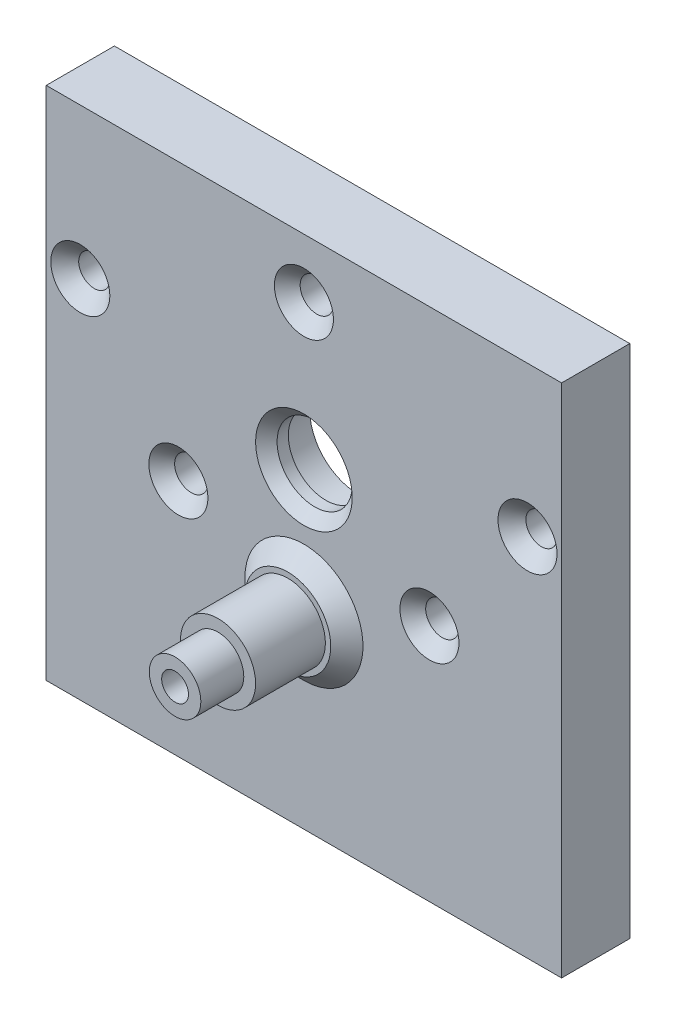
ISO-10303-21;
HEADER;
FILE_DESCRIPTION(('STEP AP214'),'2;1');
FILE_NAME('part.step','',(''),(''),'','','');
FILE_SCHEMA(('AUTOMOTIVE_DESIGN { 1 0 10303 214 1 1 1 1 }'));
ENDSEC;
DATA;
#1=APPLICATION_CONTEXT('core data for automotive mechanical design processes');
#2=APPLICATION_PROTOCOL_DEFINITION('international standard','automotive_design',2000,#1);
#3=PRODUCT_CONTEXT('',#1,'mechanical');
#4=PRODUCT('Part','Part','',(#3));
#5=PRODUCT_RELATED_PRODUCT_CATEGORY('part','',(#4));
#6=PRODUCT_DEFINITION_FORMATION('','',#4);
#7=PRODUCT_DEFINITION_CONTEXT('part definition',#1,'design');
#8=PRODUCT_DEFINITION('design','',#6,#7);
#9=PRODUCT_DEFINITION_SHAPE('','',#8);
#10=(LENGTH_UNIT() NAMED_UNIT(*) SI_UNIT(.MILLI.,.METRE.));
#11=(NAMED_UNIT(*) PLANE_ANGLE_UNIT() SI_UNIT($,.RADIAN.));
#12=(NAMED_UNIT(*) SI_UNIT($,.STERADIAN.) SOLID_ANGLE_UNIT());
#13=UNCERTAINTY_MEASURE_WITH_UNIT(LENGTH_MEASURE(1.E-05),#10,'distance_accuracy_value','');
#14=(GEOMETRIC_REPRESENTATION_CONTEXT(3) GLOBAL_UNCERTAINTY_ASSIGNED_CONTEXT((#13)) GLOBAL_UNIT_ASSIGNED_CONTEXT((#10,
#11,#12)) REPRESENTATION_CONTEXT('',''));
#15=CARTESIAN_POINT('',(0.,0.,0.));
#16=DIRECTION('',(0.,0.,1.));
#17=DIRECTION('',(1.,0.,0.));
#18=AXIS2_PLACEMENT_3D('',#15,#16,#17);
#19=CARTESIAN_POINT('',(0.,0.,6.35));
#20=DIRECTION('',(0.,0.,-1.));
#21=DIRECTION('',(-1.,0.,0.));
#22=AXIS2_PLACEMENT_3D('',#19,#20,#21);
#23=PLANE('',#22);
#24=CARTESIAN_POINT('',(35.6913429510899,22.2499999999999,6.35));
#25=DIRECTION('',(0.,0.,1.));
#26=DIRECTION('',(1.,0.,0.));
#27=AXIS2_PLACEMENT_3D('',#24,#25,#26);
#28=CIRCLE('',#27,2.75);
#29=CARTESIAN_POINT('',(38.4413429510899,22.2499999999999,6.35));
#30=VERTEX_POINT('',#29);
#31=EDGE_CURVE('E221',#30,#30,#28,.T.);
#32=ORIENTED_EDGE('',*,*,#31,.F.);
#33=EDGE_LOOP('',(#32));
#34=FACE_BOUND('',#33,.T.);
#35=CARTESIAN_POINT('',(24.,42.5,6.35));
#36=DIRECTION('',(0.,0.,1.));
#37=DIRECTION('',(1.,0.,0.));
#38=AXIS2_PLACEMENT_3D('',#35,#36,#37);
#39=CIRCLE('',#38,2.75);
#40=CARTESIAN_POINT('',(26.75,42.5,6.35));
#41=VERTEX_POINT('',#40);
#42=EDGE_CURVE('E214',#41,#41,#39,.T.);
#43=ORIENTED_EDGE('',*,*,#42,.F.);
#44=EDGE_LOOP('',(#43));
#45=FACE_BOUND('',#44,.T.);
#46=CARTESIAN_POINT('',(24.,17.5,6.35));
#47=DIRECTION('',(0.,0.,-1.));
#48=DIRECTION('',(-1.,0.,0.));
#49=AXIS2_PLACEMENT_3D('',#46,#47,#48);
#50=CIRCLE('',#49,5.49999999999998);
#51=CARTESIAN_POINT('',(18.5,17.5,6.35));
#52=VERTEX_POINT('',#51);
#53=EDGE_CURVE('E11',#52,#52,#50,.T.);
#54=ORIENTED_EDGE('',*,*,#53,.T.);
#55=EDGE_LOOP('',(#54));
#56=FACE_BOUND('',#55,.T.);
#57=CARTESIAN_POINT('',(24.,29.,6.35));
#58=DIRECTION('',(0.,0.,-1.));
#59=DIRECTION('',(-1.,0.,0.));
#60=AXIS2_PLACEMENT_3D('',#57,#58,#59);
#61=CIRCLE('',#60,4.50000000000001);
#62=CARTESIAN_POINT('',(19.5,29.,6.35));
#63=VERTEX_POINT('',#62);
#64=EDGE_CURVE('E198',#63,#63,#61,.T.);
#65=ORIENTED_EDGE('',*,*,#64,.T.);
#66=EDGE_LOOP('',(#65));
#67=FACE_BOUND('',#66,.T.);
#68=CARTESIAN_POINT('',(44.825,34.,6.35));
#69=DIRECTION('',(0.,0.,1.));
#70=DIRECTION('',(1.,0.,0.));
#71=AXIS2_PLACEMENT_3D('',#68,#69,#70);
#72=CIRCLE('',#71,2.75);
#73=CARTESIAN_POINT('',(47.575,34.,6.35));
#74=VERTEX_POINT('',#73);
#75=EDGE_CURVE('E130',#74,#74,#72,.T.);
#76=ORIENTED_EDGE('',*,*,#75,.F.);
#77=EDGE_LOOP('',(#76));
#78=FACE_BOUND('',#77,.T.);
#79=CARTESIAN_POINT('',(3.175,34.,6.35));
#80=DIRECTION('',(0.,0.,1.));
#81=DIRECTION('',(1.,0.,0.));
#82=AXIS2_PLACEMENT_3D('',#79,#80,#81);
#83=CIRCLE('',#82,2.75);
#84=CARTESIAN_POINT('',(5.925,34.,6.35));
#85=VERTEX_POINT('',#84);
#86=EDGE_CURVE('E137',#85,#85,#83,.T.);
#87=ORIENTED_EDGE('',*,*,#86,.F.);
#88=EDGE_LOOP('',(#87));
#89=FACE_BOUND('',#88,.T.);
#90=DIRECTION('',(0.,-1.,0.));
#91=VECTOR('',#90,1.);
#92=CARTESIAN_POINT('',(0.,0.,6.35));
#93=LINE('',#92,#91);
#94=CARTESIAN_POINT('',(0.,48.,6.35));
#95=VERTEX_POINT('',#94);
#96=CARTESIAN_POINT('',(0.,0.,6.35));
#97=VERTEX_POINT('',#96);
#98=EDGE_CURVE('E178',#95,#97,#93,.T.);
#99=ORIENTED_EDGE('',*,*,#98,.T.);
#100=DIRECTION('',(1.,0.,0.));
#101=VECTOR('',#100,1.);
#102=CARTESIAN_POINT('',(0.,0.,6.35));
#103=LINE('',#102,#101);
#104=CARTESIAN_POINT('',(48.,0.,6.35));
#105=VERTEX_POINT('',#104);
#106=EDGE_CURVE('E97',#97,#105,#103,.T.);
#107=ORIENTED_EDGE('',*,*,#106,.T.);
#108=DIRECTION('',(0.,1.,0.));
#109=VECTOR('',#108,1.);
#110=CARTESIAN_POINT('',(48.,0.,6.35));
#111=LINE('',#110,#109);
#112=CARTESIAN_POINT('',(48.,48.,6.35));
#113=VERTEX_POINT('',#112);
#114=EDGE_CURVE('E181',#105,#113,#111,.T.);
#115=ORIENTED_EDGE('',*,*,#114,.T.);
#116=DIRECTION('',(-1.,0.,0.));
#117=VECTOR('',#116,1.);
#118=CARTESIAN_POINT('',(0.,48.,6.35));
#119=LINE('',#118,#117);
#120=EDGE_CURVE('E65',#113,#95,#119,.T.);
#121=ORIENTED_EDGE('',*,*,#120,.T.);
#122=EDGE_LOOP('',(#99,#107,#115,#121));
#123=FACE_BOUND('',#122,.T.);
#124=CARTESIAN_POINT('',(12.30865704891,22.2500000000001,6.35));
#125=DIRECTION('',(0.,0.,1.));
#126=DIRECTION('',(1.,0.,0.));
#127=AXIS2_PLACEMENT_3D('',#124,#125,#126);
#128=CIRCLE('',#127,2.75);
#129=CARTESIAN_POINT('',(15.05865704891,22.2500000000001,6.35));
#130=VERTEX_POINT('',#129);
#131=EDGE_CURVE('E257',#130,#130,#128,.T.);
#132=ORIENTED_EDGE('',*,*,#131,.F.);
#133=EDGE_LOOP('',(#132));
#134=FACE_BOUND('',#133,.T.);
#135=ADVANCED_FACE('F45',(#34,#45,#56,#67,#78,#89,#123,#134),#23,.F.);
#136=CARTESIAN_POINT('',(0.,0.,6.35));
#137=DIRECTION('',(1.,0.,0.));
#138=DIRECTION('',(0.,0.,-1.));
#139=AXIS2_PLACEMENT_3D('',#136,#137,#138);
#140=PLANE('',#139);
#141=DIRECTION('',(0.,-1.,0.));
#142=VECTOR('',#141,1.);
#143=CARTESIAN_POINT('',(0.,0.,0.));
#144=LINE('',#143,#142);
#145=CARTESIAN_POINT('',(0.,48.,0.));
#146=VERTEX_POINT('',#145);
#147=CARTESIAN_POINT('',(0.,0.,0.));
#148=VERTEX_POINT('',#147);
#149=EDGE_CURVE('E175',#146,#148,#144,.T.);
#150=ORIENTED_EDGE('',*,*,#149,.T.);
#151=DIRECTION('',(0.,0.,-1.));
#152=VECTOR('',#151,1.);
#153=CARTESIAN_POINT('',(0.,0.,6.35));
#154=LINE('',#153,#152);
#155=EDGE_CURVE('E196',#97,#148,#154,.T.);
#156=ORIENTED_EDGE('',*,*,#155,.F.);
#157=ORIENTED_EDGE('',*,*,#98,.F.);
#158=DIRECTION('',(0.,0.,-1.));
#159=VECTOR('',#158,1.);
#160=CARTESIAN_POINT('',(0.,48.,6.35));
#161=LINE('',#160,#159);
#162=EDGE_CURVE('E184',#95,#146,#161,.T.);
#163=ORIENTED_EDGE('',*,*,#162,.T.);
#164=EDGE_LOOP('',(#150,#156,#157,#163));
#165=FACE_BOUND('',#164,.T.);
#166=ADVANCED_FACE('F242',(#165),#140,.F.);
#167=CARTESIAN_POINT('',(0.,0.,6.35));
#168=DIRECTION('',(0.,1.,0.));
#169=DIRECTION('',(0.,0.,1.));
#170=AXIS2_PLACEMENT_3D('',#167,#168,#169);
#171=PLANE('',#170);
#172=CARTESIAN_POINT('',(3.175,0.,3.175));
#173=DIRECTION('',(0.,-1.,0.));
#174=DIRECTION('',(0.,0.,-1.));
#175=AXIS2_PLACEMENT_3D('',#172,#173,#174);
#176=CIRCLE('',#175,1.02499999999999);
#177=CARTESIAN_POINT('',(3.175,0.,2.15000000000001));
#178=VERTEX_POINT('',#177);
#179=EDGE_CURVE('E118',#178,#178,#176,.T.);
#180=ORIENTED_EDGE('',*,*,#179,.F.);
#181=EDGE_LOOP('',(#180));
#182=FACE_BOUND('',#181,.T.);
#183=CARTESIAN_POINT('',(44.825,0.,3.175));
#184=DIRECTION('',(0.,-1.,0.));
#185=DIRECTION('',(0.,0.,-1.));
#186=AXIS2_PLACEMENT_3D('',#183,#184,#185);
#187=CIRCLE('',#186,1.02499999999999);
#188=CARTESIAN_POINT('',(44.825,0.,2.15000000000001));
#189=VERTEX_POINT('',#188);
#190=EDGE_CURVE('E117',#189,#189,#187,.T.);
#191=ORIENTED_EDGE('',*,*,#190,.F.);
#192=EDGE_LOOP('',(#191));
#193=FACE_BOUND('',#192,.T.);
#194=DIRECTION('',(1.,0.,0.));
#195=VECTOR('',#194,1.);
#196=CARTESIAN_POINT('',(0.,0.,0.));
#197=LINE('',#196,#195);
#198=CARTESIAN_POINT('',(48.,0.,0.));
#199=VERTEX_POINT('',#198);
#200=EDGE_CURVE('E187',#148,#199,#197,.T.);
#201=ORIENTED_EDGE('',*,*,#200,.T.);
#202=DIRECTION('',(0.,0.,-1.));
#203=VECTOR('',#202,1.);
#204=CARTESIAN_POINT('',(48.,0.,6.35));
#205=LINE('',#204,#203);
#206=EDGE_CURVE('E194',#105,#199,#205,.T.);
#207=ORIENTED_EDGE('',*,*,#206,.F.);
#208=ORIENTED_EDGE('',*,*,#106,.F.);
#209=ORIENTED_EDGE('',*,*,#155,.T.);
#210=EDGE_LOOP('',(#201,#207,#208,#209));
#211=FACE_BOUND('',#210,.T.);
#212=ADVANCED_FACE('F299',(#182,#193,#211),#171,.F.);
#213=CARTESIAN_POINT('',(48.,0.,6.35));
#214=DIRECTION('',(-1.,0.,0.));
#215=DIRECTION('',(0.,0.,1.));
#216=AXIS2_PLACEMENT_3D('',#213,#214,#215);
#217=PLANE('',#216);
#218=DIRECTION('',(0.,1.,0.));
#219=VECTOR('',#218,1.);
#220=CARTESIAN_POINT('',(48.,0.,0.));
#221=LINE('',#220,#219);
#222=CARTESIAN_POINT('',(48.,48.,0.));
#223=VERTEX_POINT('',#222);
#224=EDGE_CURVE('E83',#199,#223,#221,.T.);
#225=ORIENTED_EDGE('',*,*,#224,.T.);
#226=DIRECTION('',(0.,0.,-1.));
#227=VECTOR('',#226,1.);
#228=CARTESIAN_POINT('',(48.,48.,6.35));
#229=LINE('',#228,#227);
#230=EDGE_CURVE('E192',#113,#223,#229,.T.);
#231=ORIENTED_EDGE('',*,*,#230,.F.);
#232=ORIENTED_EDGE('',*,*,#114,.F.);
#233=ORIENTED_EDGE('',*,*,#206,.T.);
#234=EDGE_LOOP('',(#225,#231,#232,#233));
#235=FACE_BOUND('',#234,.T.);
#236=ADVANCED_FACE('F298',(#235),#217,.F.);
#237=CARTESIAN_POINT('',(0.,48.,6.35));
#238=DIRECTION('',(0.,-1.,0.));
#239=DIRECTION('',(0.,0.,-1.));
#240=AXIS2_PLACEMENT_3D('',#237,#238,#239);
#241=PLANE('',#240);
#242=DIRECTION('',(-1.,0.,0.));
#243=VECTOR('',#242,1.);
#244=CARTESIAN_POINT('',(0.,48.,0.));
#245=LINE('',#244,#243);
#246=EDGE_CURVE('E89',#223,#146,#245,.T.);
#247=ORIENTED_EDGE('',*,*,#246,.T.);
#248=ORIENTED_EDGE('',*,*,#162,.F.);
#249=ORIENTED_EDGE('',*,*,#120,.F.);
#250=ORIENTED_EDGE('',*,*,#230,.T.);
#251=EDGE_LOOP('',(#247,#248,#249,#250));
#252=FACE_BOUND('',#251,.T.);
#253=ADVANCED_FACE('F292',(#252),#241,.F.);
#254=CARTESIAN_POINT('',(0.,0.,0.));
#255=DIRECTION('',(0.,0.,-1.));
#256=DIRECTION('',(-1.,0.,0.));
#257=AXIS2_PLACEMENT_3D('',#254,#255,#256);
#258=PLANE('',#257);
#259=CARTESIAN_POINT('',(44.825,34.,0.));
#260=DIRECTION('',(0.,0.,-1.));
#261=DIRECTION('',(-1.,0.,0.));
#262=AXIS2_PLACEMENT_3D('',#259,#260,#261);
#263=CIRCLE('',#262,1.44999999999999);
#264=CARTESIAN_POINT('',(43.375,34.,0.));
#265=VERTEX_POINT('',#264);
#266=EDGE_CURVE('E136',#265,#265,#263,.T.);
#267=ORIENTED_EDGE('',*,*,#266,.F.);
#268=EDGE_LOOP('',(#267));
#269=FACE_BOUND('',#268,.T.);
#270=CARTESIAN_POINT('',(3.175,34.,0.));
#271=DIRECTION('',(0.,0.,-1.));
#272=DIRECTION('',(-1.,0.,0.));
#273=AXIS2_PLACEMENT_3D('',#270,#271,#272);
#274=CIRCLE('',#273,1.44999999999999);
#275=CARTESIAN_POINT('',(1.72500000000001,34.,0.));
#276=VERTEX_POINT('',#275);
#277=EDGE_CURVE('E143',#276,#276,#274,.T.);
#278=ORIENTED_EDGE('',*,*,#277,.F.);
#279=EDGE_LOOP('',(#278));
#280=FACE_BOUND('',#279,.T.);
#281=CARTESIAN_POINT('',(24.,29.,0.));
#282=DIRECTION('',(0.,0.,-1.));
#283=DIRECTION('',(-1.,0.,0.));
#284=AXIS2_PLACEMENT_3D('',#281,#282,#283);
#285=CIRCLE('',#284,17.5);
#286=CARTESIAN_POINT('',(6.5,29.,0.));
#287=VERTEX_POINT('',#286);
#288=EDGE_CURVE('E151',#287,#287,#285,.T.);
#289=ORIENTED_EDGE('',*,*,#288,.F.);
#290=EDGE_LOOP('',(#289));
#291=FACE_BOUND('',#290,.T.);
#292=ORIENTED_EDGE('',*,*,#149,.F.);
#293=ORIENTED_EDGE('',*,*,#246,.F.);
#294=ORIENTED_EDGE('',*,*,#224,.F.);
#295=ORIENTED_EDGE('',*,*,#200,.F.);
#296=EDGE_LOOP('',(#292,#293,#294,#295));
#297=FACE_BOUND('',#296,.T.);
#298=ADVANCED_FACE('F288',(#269,#280,#291,#297),#258,.T.);
#299=CARTESIAN_POINT('',(24.,17.5,7.85));
#300=DIRECTION('',(0.,0.,1.));
#301=DIRECTION('',(1.,0.,0.));
#302=AXIS2_PLACEMENT_3D('',#299,#300,#301);
#303=PLANE('',#302);
#304=CARTESIAN_POINT('',(24.,17.5,7.85));
#305=DIRECTION('',(0.,0.,1.));
#306=DIRECTION('',(1.,0.,0.));
#307=AXIS2_PLACEMENT_3D('',#304,#305,#306);
#308=CIRCLE('',#307,3.99999999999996);
#309=CARTESIAN_POINT('',(28.,17.5,7.85));
#310=VERTEX_POINT('',#309);
#311=EDGE_CURVE('E56',#310,#310,#308,.T.);
#312=ORIENTED_EDGE('',*,*,#311,.T.);
#313=EDGE_LOOP('',(#312));
#314=FACE_BOUND('',#313,.T.);
#315=CARTESIAN_POINT('',(24.,17.5,7.85));
#316=DIRECTION('',(0.,0.,1.));
#317=DIRECTION('',(1.,0.,0.));
#318=AXIS2_PLACEMENT_3D('',#315,#316,#317);
#319=CIRCLE('',#318,3.5);
#320=CARTESIAN_POINT('',(27.5,17.5,7.85));
#321=VERTEX_POINT('',#320);
#322=EDGE_CURVE('E166',#321,#321,#319,.T.);
#323=ORIENTED_EDGE('',*,*,#322,.F.);
#324=EDGE_LOOP('',(#323));
#325=FACE_BOUND('',#324,.T.);
#326=ADVANCED_FACE('F291',(#314,#325),#303,.T.);
#327=CARTESIAN_POINT('',(24.,17.5,7.85));
#328=DIRECTION('',(0.,0.,1.));
#329=DIRECTION('',(1.,0.,0.));
#330=AXIS2_PLACEMENT_3D('',#327,#328,#329);
#331=CYLINDRICAL_SURFACE('',#330,3.5);
#332=CARTESIAN_POINT('',(24.,17.5,14.35));
#333=DIRECTION('',(0.,0.,1.));
#334=DIRECTION('',(1.,0.,0.));
#335=AXIS2_PLACEMENT_3D('',#332,#333,#334);
#336=CIRCLE('',#335,3.5);
#337=CARTESIAN_POINT('',(27.5,17.5,14.35));
#338=VERTEX_POINT('',#337);
#339=EDGE_CURVE('E165',#338,#338,#336,.T.);
#340=CARTESIAN_POINT('',(27.5,17.5,7.85));
#341=CARTESIAN_POINT('',(27.5,17.5,7.91770833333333));
#342=CARTESIAN_POINT('',(27.5,17.5,7.98541666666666));
#343=CARTESIAN_POINT('',(27.5,17.5,8.12083333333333));
#344=CARTESIAN_POINT('',(27.5,17.5,8.18854166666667));
#345=CARTESIAN_POINT('',(27.5,17.5,8.32395833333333));
#346=CARTESIAN_POINT('',(27.5,17.5,8.39166666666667));
#347=CARTESIAN_POINT('',(27.5,17.5,8.52708333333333));
#348=CARTESIAN_POINT('',(27.5,17.5,8.59479166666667));
#349=CARTESIAN_POINT('',(27.5,17.5,8.73020833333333));
#350=CARTESIAN_POINT('',(27.5,17.5,8.79791666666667));
#351=CARTESIAN_POINT('',(27.5,17.5,8.93333333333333));
#352=CARTESIAN_POINT('',(27.5,17.5,9.00104166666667));
#353=CARTESIAN_POINT('',(27.5,17.5,9.13645833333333));
#354=CARTESIAN_POINT('',(27.5,17.5,9.20416666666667));
#355=CARTESIAN_POINT('',(27.5,17.5,9.33958333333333));
#356=CARTESIAN_POINT('',(27.5,17.5,9.40729166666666));
#357=CARTESIAN_POINT('',(27.5,17.5,9.54270833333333));
#358=CARTESIAN_POINT('',(27.5,17.5,9.61041666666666));
#359=CARTESIAN_POINT('',(27.5,17.5,9.74583333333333));
#360=CARTESIAN_POINT('',(27.5,17.5,9.81354166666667));
#361=CARTESIAN_POINT('',(27.5,17.5,9.94895833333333));
#362=CARTESIAN_POINT('',(27.5,17.5,10.0166666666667));
#363=CARTESIAN_POINT('',(27.5,17.5,10.1520833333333));
#364=CARTESIAN_POINT('',(27.5,17.5,10.2197916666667));
#365=CARTESIAN_POINT('',(27.5,17.5,10.3552083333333));
#366=CARTESIAN_POINT('',(27.5,17.5,10.4229166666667));
#367=CARTESIAN_POINT('',(27.5,17.5,10.5583333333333));
#368=CARTESIAN_POINT('',(27.5,17.5,10.6260416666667));
#369=CARTESIAN_POINT('',(27.5,17.5,10.7614583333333));
#370=CARTESIAN_POINT('',(27.5,17.5,10.8291666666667));
#371=CARTESIAN_POINT('',(27.5,17.5,10.9645833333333));
#372=CARTESIAN_POINT('',(27.5,17.5,11.0322916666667));
#373=CARTESIAN_POINT('',(27.5,17.5,11.1677083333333));
#374=CARTESIAN_POINT('',(27.5,17.5,11.2354166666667));
#375=CARTESIAN_POINT('',(27.5,17.5,11.3708333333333));
#376=CARTESIAN_POINT('',(27.5,17.5,11.4385416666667));
#377=CARTESIAN_POINT('',(27.5,17.5,11.5739583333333));
#378=CARTESIAN_POINT('',(27.5,17.5,11.6416666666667));
#379=CARTESIAN_POINT('',(27.5,17.5,11.7770833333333));
#380=CARTESIAN_POINT('',(27.5,17.5,11.8447916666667));
#381=CARTESIAN_POINT('',(27.5,17.5,11.9802083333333));
#382=CARTESIAN_POINT('',(27.5,17.5,12.0479166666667));
#383=CARTESIAN_POINT('',(27.5,17.5,12.1833333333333));
#384=CARTESIAN_POINT('',(27.5,17.5,12.2510416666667));
#385=CARTESIAN_POINT('',(27.5,17.5,12.3864583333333));
#386=CARTESIAN_POINT('',(27.5,17.5,12.4541666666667));
#387=CARTESIAN_POINT('',(27.5,17.5,12.5895833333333));
#388=CARTESIAN_POINT('',(27.5,17.5,12.6572916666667));
#389=CARTESIAN_POINT('',(27.5,17.5,12.7927083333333));
#390=CARTESIAN_POINT('',(27.5,17.5,12.8604166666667));
#391=CARTESIAN_POINT('',(27.5,17.5,12.9958333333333));
#392=CARTESIAN_POINT('',(27.5,17.5,13.0635416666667));
#393=CARTESIAN_POINT('',(27.5,17.5,13.1989583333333));
#394=CARTESIAN_POINT('',(27.5,17.5,13.2666666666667));
#395=CARTESIAN_POINT('',(27.5,17.5,13.4020833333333));
#396=CARTESIAN_POINT('',(27.5,17.5,13.4697916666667));
#397=CARTESIAN_POINT('',(27.5,17.5,13.6052083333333));
#398=CARTESIAN_POINT('',(27.5,17.5,13.6729166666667));
#399=CARTESIAN_POINT('',(27.5,17.5,13.8083333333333));
#400=CARTESIAN_POINT('',(27.5,17.5,13.8760416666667));
#401=CARTESIAN_POINT('',(27.5,17.5,14.0114583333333));
#402=CARTESIAN_POINT('',(27.5,17.5,14.0791666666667));
#403=CARTESIAN_POINT('',(27.5,17.5,14.2145833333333));
#404=CARTESIAN_POINT('',(27.5,17.5,14.2822916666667));
#405=CARTESIAN_POINT('',(27.5,17.5,14.35));
#406=B_SPLINE_CURVE_WITH_KNOTS('',3,(#340,#341,#342,#343,#344,#345,#346,#347,#348,#349,#350,
#351,#352,#353,#354,#355,#356,#357,#358,#359,#360,#361,#362,#363,#364,#365,#366,#367,#368,#369,
#370,#371,#372,#373,#374,#375,#376,#377,#378,#379,#380,#381,#382,#383,#384,#385,#386,#387,#388,
#389,#390,#391,#392,#393,#394,#395,#396,#397,#398,#399,#400,#401,#402,#403,#404,#405),
.UNSPECIFIED.,.F.,.F.,(4,2,2,2,2,2,2,2,2,2,2,2,2,2,2,2,2,2,2,2,2,2,2,2,2,2,2,2,2,2,2,2,4),(0.,
0.203124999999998,0.406249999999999,0.609374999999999,0.812499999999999,1.015625,1.21875,
1.421875,1.625,1.828125,2.03125,2.234375,2.4375,2.640625,2.84375,3.046875,3.25,3.453125,3.65625,
3.859375,4.0625,4.265625,4.46875,4.671875,4.875,5.078125,5.28125,5.484375,5.6875,5.890625,
6.09375,6.296875,6.5),.UNSPECIFIED.);
#407=EDGE_CURVE('BSEAM354',#321,#338,#406,.T.);
#408=ORIENTED_EDGE('',*,*,#322,.T.);
#409=ORIENTED_EDGE('',*,*,#339,.F.);
#410=ORIENTED_EDGE('',*,*,#407,.T.);
#411=ORIENTED_EDGE('',*,*,#407,.F.);
#412=EDGE_LOOP('',(#408,#410,#409,#411));
#413=FACE_BOUND('',#412,.T.);
#414=ADVANCED_FACE('F354',(#413),#331,.T.);
#415=CARTESIAN_POINT('',(24.,17.5,18.35));
#416=DIRECTION('',(0.,0.,1.));
#417=DIRECTION('',(1.,0.,0.));
#418=AXIS2_PLACEMENT_3D('',#415,#416,#417);
#419=PLANE('',#418);
#420=CARTESIAN_POINT('',(24.,17.5,18.35));
#421=DIRECTION('',(0.,0.,1.));
#422=DIRECTION('',(1.,0.,0.));
#423=AXIS2_PLACEMENT_3D('',#420,#421,#422);
#424=CIRCLE('',#423,1.25);
#425=CARTESIAN_POINT('',(25.25,17.5,18.35));
#426=VERTEX_POINT('',#425);
#427=EDGE_CURVE('E157',#426,#426,#424,.T.);
#428=ORIENTED_EDGE('',*,*,#427,.F.);
#429=EDGE_LOOP('',(#428));
#430=FACE_BOUND('',#429,.T.);
#431=CARTESIAN_POINT('',(24.,17.5,18.35));
#432=DIRECTION('',(0.,0.,1.));
#433=DIRECTION('',(1.,0.,0.));
#434=AXIS2_PLACEMENT_3D('',#431,#432,#433);
#435=CIRCLE('',#434,2.4);
#436=CARTESIAN_POINT('',(26.4,17.5,18.35));
#437=VERTEX_POINT('',#436);
#438=EDGE_CURVE('E169',#437,#437,#435,.T.);
#439=ORIENTED_EDGE('',*,*,#438,.T.);
#440=EDGE_LOOP('',(#439));
#441=FACE_BOUND('',#440,.T.);
#442=ADVANCED_FACE('F357',(#430,#441),#419,.T.);
#443=CARTESIAN_POINT('',(24.,17.5,14.35));
#444=DIRECTION('',(0.,0.,1.));
#445=DIRECTION('',(1.,0.,0.));
#446=AXIS2_PLACEMENT_3D('',#443,#444,#445);
#447=CYLINDRICAL_SURFACE('',#446,2.4);
#448=CARTESIAN_POINT('',(24.,17.5,14.35));
#449=DIRECTION('',(0.,0.,1.));
#450=DIRECTION('',(1.,0.,0.));
#451=AXIS2_PLACEMENT_3D('',#448,#449,#450);
#452=CIRCLE('',#451,2.4);
#453=CARTESIAN_POINT('',(26.4,17.5,14.35));
#454=VERTEX_POINT('',#453);
#455=EDGE_CURVE('E172',#454,#454,#452,.T.);
#456=ORIENTED_EDGE('',*,*,#455,.T.);
#457=EDGE_LOOP('',(#456));
#458=FACE_BOUND('',#457,.T.);
#459=ORIENTED_EDGE('',*,*,#438,.F.);
#460=EDGE_LOOP('',(#459));
#461=FACE_BOUND('',#460,.T.);
#462=ADVANCED_FACE('F362',(#458,#461),#447,.T.);
#463=CARTESIAN_POINT('',(24.,17.5,14.35));
#464=DIRECTION('',(0.,0.,1.));
#465=DIRECTION('',(1.,0.,0.));
#466=AXIS2_PLACEMENT_3D('',#463,#464,#465);
#467=PLANE('',#466);
#468=ORIENTED_EDGE('',*,*,#455,.F.);
#469=EDGE_LOOP('',(#468));
#470=FACE_BOUND('',#469,.T.);
#471=ORIENTED_EDGE('',*,*,#339,.T.);
#472=EDGE_LOOP('',(#471));
#473=FACE_BOUND('',#472,.T.);
#474=ADVANCED_FACE('F352',(#470,#473),#467,.T.);
#475=CARTESIAN_POINT('',(24.,17.5,9.85));
#476=DIRECTION('',(0.,0.,1.));
#477=DIRECTION('',(1.,0.,0.));
#478=AXIS2_PLACEMENT_3D('',#475,#476,#477);
#479=CONICAL_SURFACE('',#478,1.25,1.02974425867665);
#480=CARTESIAN_POINT('',(24.,17.5,9.09892422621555));
#481=VERTEX_POINT('',#480);
#482=VERTEX_LOOP('',#481);
#483=FACE_BOUND('',#482,.T.);
#484=CARTESIAN_POINT('',(24.,17.5,9.85));
#485=DIRECTION('',(0.,0.,1.));
#486=DIRECTION('',(1.,0.,0.));
#487=AXIS2_PLACEMENT_3D('',#484,#485,#486);
#488=CIRCLE('',#487,1.25);
#489=CARTESIAN_POINT('',(25.25,17.5,9.85));
#490=VERTEX_POINT('',#489);
#491=EDGE_CURVE('E162',#490,#490,#488,.T.);
#492=ORIENTED_EDGE('',*,*,#491,.T.);
#493=EDGE_LOOP('',(#492));
#494=FACE_BOUND('',#493,.T.);
#495=ADVANCED_FACE('F348',(#483,#494),#479,.F.);
#496=CARTESIAN_POINT('',(24.,17.5,18.35));
#497=DIRECTION('',(0.,0.,1.));
#498=DIRECTION('',(1.,0.,0.));
#499=AXIS2_PLACEMENT_3D('',#496,#497,#498);
#500=CYLINDRICAL_SURFACE('',#499,1.25);
#501=ORIENTED_EDGE('',*,*,#491,.F.);
#502=EDGE_LOOP('',(#501));
#503=FACE_BOUND('',#502,.T.);
#504=ORIENTED_EDGE('',*,*,#427,.T.);
#505=EDGE_LOOP('',(#504));
#506=FACE_BOUND('',#505,.T.);
#507=ADVANCED_FACE('F284',(#503,#506),#500,.F.);
#508=CARTESIAN_POINT('',(24.,29.,1.3));
#509=DIRECTION('',(0.,0.,-1.));
#510=DIRECTION('',(-1.,0.,0.));
#511=AXIS2_PLACEMENT_3D('',#508,#509,#510);
#512=CYLINDRICAL_SURFACE('',#511,17.5);
#513=CARTESIAN_POINT('',(24.,29.,1.3));
#514=DIRECTION('',(0.,0.,-1.));
#515=DIRECTION('',(-1.,0.,0.));
#516=AXIS2_PLACEMENT_3D('',#513,#514,#515);
#517=CIRCLE('',#516,17.5);
#518=CARTESIAN_POINT('',(6.5,29.,1.3));
#519=VERTEX_POINT('',#518);
#520=EDGE_CURVE('E154',#519,#519,#517,.T.);
#521=ORIENTED_EDGE('',*,*,#520,.F.);
#522=EDGE_LOOP('',(#521));
#523=FACE_BOUND('',#522,.T.);
#524=ORIENTED_EDGE('',*,*,#288,.T.);
#525=EDGE_LOOP('',(#524));
#526=FACE_BOUND('',#525,.T.);
#527=ADVANCED_FACE('F273',(#523,#526),#512,.F.);
#528=CARTESIAN_POINT('',(24.,29.,1.3));
#529=DIRECTION('',(0.,0.,-1.));
#530=DIRECTION('',(-1.,0.,0.));
#531=AXIS2_PLACEMENT_3D('',#528,#529,#530);
#532=PLANE('',#531);
#533=CARTESIAN_POINT('',(12.30865704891,22.2500000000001,1.3));
#534=DIRECTION('',(0.,0.,-1.));
#535=DIRECTION('',(-1.,0.,0.));
#536=AXIS2_PLACEMENT_3D('',#533,#534,#535);
#537=CIRCLE('',#536,1.54999999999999);
#538=CARTESIAN_POINT('',(10.75865704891,22.2500000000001,1.3));
#539=VERTEX_POINT('',#538);
#540=EDGE_CURVE('E50',#539,#539,#537,.T.);
#541=ORIENTED_EDGE('',*,*,#540,.F.);
#542=EDGE_LOOP('',(#541));
#543=FACE_BOUND('',#542,.T.);
#544=CARTESIAN_POINT('',(35.6913429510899,22.2499999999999,1.3));
#545=DIRECTION('',(0.,0.,-1.));
#546=DIRECTION('',(-1.,0.,0.));
#547=AXIS2_PLACEMENT_3D('',#544,#545,#546);
#548=CIRCLE('',#547,1.54999999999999);
#549=CARTESIAN_POINT('',(34.1413429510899,22.2499999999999,1.3));
#550=VERTEX_POINT('',#549);
#551=EDGE_CURVE('E212',#550,#550,#548,.T.);
#552=ORIENTED_EDGE('',*,*,#551,.F.);
#553=EDGE_LOOP('',(#552));
#554=FACE_BOUND('',#553,.T.);
#555=CARTESIAN_POINT('',(24.,42.5,1.3));
#556=DIRECTION('',(0.,0.,-1.));
#557=DIRECTION('',(-1.,0.,0.));
#558=AXIS2_PLACEMENT_3D('',#555,#556,#557);
#559=CIRCLE('',#558,1.54999999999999);
#560=CARTESIAN_POINT('',(22.45,42.5,1.3));
#561=VERTEX_POINT('',#560);
#562=EDGE_CURVE('E124',#561,#561,#559,.T.);
#563=ORIENTED_EDGE('',*,*,#562,.F.);
#564=EDGE_LOOP('',(#563));
#565=FACE_BOUND('',#564,.T.);
#566=CARTESIAN_POINT('',(24.,29.,1.3));
#567=DIRECTION('',(0.,0.,-1.));
#568=DIRECTION('',(-1.,0.,0.));
#569=AXIS2_PLACEMENT_3D('',#566,#567,#568);
#570=CIRCLE('',#569,4.5);
#571=CARTESIAN_POINT('',(19.5,29.,1.3));
#572=VERTEX_POINT('',#571);
#573=EDGE_CURVE('E147',#572,#572,#570,.T.);
#574=ORIENTED_EDGE('',*,*,#573,.F.);
#575=EDGE_LOOP('',(#574));
#576=FACE_BOUND('',#575,.T.);
#577=ORIENTED_EDGE('',*,*,#520,.T.);
#578=EDGE_LOOP('',(#577));
#579=FACE_BOUND('',#578,.T.);
#580=ADVANCED_FACE('F269',(#543,#554,#565,#576,#579),#532,.T.);
#581=CARTESIAN_POINT('',(24.,29.,4.3));
#582=DIRECTION('',(0.,0.,-1.));
#583=DIRECTION('',(-1.,0.,0.));
#584=AXIS2_PLACEMENT_3D('',#581,#582,#583);
#585=CYLINDRICAL_SURFACE('',#584,4.5);
#586=CARTESIAN_POINT('',(24.,29.,4.3));
#587=DIRECTION('',(0.,0.,-1.));
#588=DIRECTION('',(-1.,0.,0.));
#589=AXIS2_PLACEMENT_3D('',#586,#587,#588);
#590=CIRCLE('',#589,4.5);
#591=CARTESIAN_POINT('',(19.5,29.,4.3));
#592=VERTEX_POINT('',#591);
#593=EDGE_CURVE('E148',#592,#592,#590,.T.);
#594=ORIENTED_EDGE('',*,*,#593,.F.);
#595=EDGE_LOOP('',(#594));
#596=FACE_BOUND('',#595,.T.);
#597=ORIENTED_EDGE('',*,*,#573,.T.);
#598=EDGE_LOOP('',(#597));
#599=FACE_BOUND('',#598,.T.);
#600=ADVANCED_FACE('F272',(#596,#599),#585,.F.);
#601=CARTESIAN_POINT('',(24.,29.,4.3));
#602=DIRECTION('',(0.,0.,-1.));
#603=DIRECTION('',(-1.,0.,0.));
#604=AXIS2_PLACEMENT_3D('',#601,#602,#603);
#605=PLANE('',#604);
#606=CARTESIAN_POINT('',(24.,29.,4.3));
#607=DIRECTION('',(0.,0.,-1.));
#608=DIRECTION('',(-1.,0.,0.));
#609=AXIS2_PLACEMENT_3D('',#606,#607,#608);
#610=CIRCLE('',#609,3.5);
#611=CARTESIAN_POINT('',(20.5,29.,4.3));
#612=VERTEX_POINT('',#611);
#613=EDGE_CURVE('E144',#612,#612,#610,.T.);
#614=ORIENTED_EDGE('',*,*,#613,.F.);
#615=EDGE_LOOP('',(#614));
#616=FACE_BOUND('',#615,.T.);
#617=ORIENTED_EDGE('',*,*,#593,.T.);
#618=EDGE_LOOP('',(#617));
#619=FACE_BOUND('',#618,.T.);
#620=ADVANCED_FACE('F331',(#616,#619),#605,.T.);
#621=CARTESIAN_POINT('',(24.,29.,14.3));
#622=DIRECTION('',(0.,0.,-1.));
#623=DIRECTION('',(-1.,0.,0.));
#624=AXIS2_PLACEMENT_3D('',#621,#622,#623);
#625=CYLINDRICAL_SURFACE('',#624,3.5);
#626=CARTESIAN_POINT('',(24.,29.,5.34999999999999));
#627=DIRECTION('',(0.,0.,-1.));
#628=DIRECTION('',(-1.,0.,0.));
#629=AXIS2_PLACEMENT_3D('',#626,#627,#628);
#630=CIRCLE('',#629,3.5);
#631=CARTESIAN_POINT('',(20.5,29.,5.34999999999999));
#632=VERTEX_POINT('',#631);
#633=EDGE_CURVE('E205',#632,#632,#630,.F.);
#634=ORIENTED_EDGE('',*,*,#633,.T.);
#635=EDGE_LOOP('',(#634));
#636=FACE_BOUND('',#635,.T.);
#637=ORIENTED_EDGE('',*,*,#613,.T.);
#638=EDGE_LOOP('',(#637));
#639=FACE_BOUND('',#638,.T.);
#640=ADVANCED_FACE('F327',(#636,#639),#625,.F.);
#641=CARTESIAN_POINT('',(3.175,34.,6.35));
#642=DIRECTION('',(0.,0.,1.));
#643=DIRECTION('',(1.,0.,0.));
#644=AXIS2_PLACEMENT_3D('',#641,#642,#643);
#645=CYLINDRICAL_SURFACE('',#644,1.44999999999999);
#646=ORIENTED_EDGE('',*,*,#277,.T.);
#647=EDGE_LOOP('',(#646));
#648=FACE_BOUND('',#647,.T.);
#649=CARTESIAN_POINT('',(3.175,34.,5.04999999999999));
#650=DIRECTION('',(0.,0.,1.));
#651=DIRECTION('',(1.,0.,0.));
#652=AXIS2_PLACEMENT_3D('',#649,#650,#651);
#653=CIRCLE('',#652,1.44999999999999);
#654=CARTESIAN_POINT('',(4.62499999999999,34.,5.04999999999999));
#655=VERTEX_POINT('',#654);
#656=EDGE_CURVE('E140',#655,#655,#653,.T.);
#657=ORIENTED_EDGE('',*,*,#656,.T.);
#658=EDGE_LOOP('',(#657));
#659=FACE_BOUND('',#658,.T.);
#660=ADVANCED_FACE('F330',(#648,#659),#645,.F.);
#661=CARTESIAN_POINT('',(3.175,34.,6.35));
#662=DIRECTION('',(0.,0.,1.));
#663=DIRECTION('',(1.,0.,0.));
#664=AXIS2_PLACEMENT_3D('',#661,#662,#663);
#665=CONICAL_SURFACE('',#664,2.75,0.785398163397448);
#666=ORIENTED_EDGE('',*,*,#656,.F.);
#667=EDGE_LOOP('',(#666));
#668=FACE_BOUND('',#667,.T.);
#669=ORIENTED_EDGE('',*,*,#86,.T.);
#670=EDGE_LOOP('',(#669));
#671=FACE_BOUND('',#670,.T.);
#672=ADVANCED_FACE('F484',(#668,#671),#665,.F.);
#673=CARTESIAN_POINT('',(44.825,34.,6.35));
#674=DIRECTION('',(0.,0.,1.));
#675=DIRECTION('',(1.,0.,0.));
#676=AXIS2_PLACEMENT_3D('',#673,#674,#675);
#677=CYLINDRICAL_SURFACE('',#676,1.44999999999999);
#678=ORIENTED_EDGE('',*,*,#266,.T.);
#679=EDGE_LOOP('',(#678));
#680=FACE_BOUND('',#679,.T.);
#681=CARTESIAN_POINT('',(44.825,34.,5.04999999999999));
#682=DIRECTION('',(0.,0.,1.));
#683=DIRECTION('',(1.,0.,0.));
#684=AXIS2_PLACEMENT_3D('',#681,#682,#683);
#685=CIRCLE('',#684,1.44999999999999);
#686=CARTESIAN_POINT('',(46.275,34.,5.04999999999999));
#687=VERTEX_POINT('',#686);
#688=EDGE_CURVE('E133',#687,#687,#685,.T.);
#689=ORIENTED_EDGE('',*,*,#688,.T.);
#690=EDGE_LOOP('',(#689));
#691=FACE_BOUND('',#690,.T.);
#692=ADVANCED_FACE('F480',(#680,#691),#677,.F.);
#693=CARTESIAN_POINT('',(44.825,34.,6.35));
#694=DIRECTION('',(0.,0.,1.));
#695=DIRECTION('',(1.,0.,0.));
#696=AXIS2_PLACEMENT_3D('',#693,#694,#695);
#697=CONICAL_SURFACE('',#696,2.75,0.785398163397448);
#698=ORIENTED_EDGE('',*,*,#688,.F.);
#699=EDGE_LOOP('',(#698));
#700=FACE_BOUND('',#699,.T.);
#701=ORIENTED_EDGE('',*,*,#75,.T.);
#702=EDGE_LOOP('',(#701));
#703=FACE_BOUND('',#702,.T.);
#704=ADVANCED_FACE('F476',(#700,#703),#697,.F.);
#705=CARTESIAN_POINT('',(44.825,9.38411786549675,3.175));
#706=DIRECTION('',(0.,-1.,0.));
#707=DIRECTION('',(0.,0.,-1.));
#708=AXIS2_PLACEMENT_3D('',#705,#706,#707);
#709=CONICAL_SURFACE('',#708,1.025,1.02974425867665);
#710=CARTESIAN_POINT('',(44.825,10.,3.175));
#711=VERTEX_POINT('',#710);
#712=VERTEX_LOOP('',#711);
#713=FACE_BOUND('',#712,.T.);
#714=CARTESIAN_POINT('',(44.825,9.38411786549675,3.175));
#715=DIRECTION('',(0.,-1.,0.));
#716=DIRECTION('',(0.,0.,-1.));
#717=AXIS2_PLACEMENT_3D('',#714,#715,#716);
#718=CIRCLE('',#717,1.025);
#719=CARTESIAN_POINT('',(44.825,9.38411786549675,2.15));
#720=VERTEX_POINT('',#719);
#721=EDGE_CURVE('E121',#720,#720,#718,.T.);
#722=ORIENTED_EDGE('',*,*,#721,.T.);
#723=EDGE_LOOP('',(#722));
#724=FACE_BOUND('',#723,.T.);
#725=ADVANCED_FACE('F472',(#713,#724),#709,.F.);
#726=CARTESIAN_POINT('',(44.825,0.,3.175));
#727=DIRECTION('',(0.,-1.,0.));
#728=DIRECTION('',(0.,0.,-1.));
#729=AXIS2_PLACEMENT_3D('',#726,#727,#728);
#730=CYLINDRICAL_SURFACE('',#729,1.02499999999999);
#731=ORIENTED_EDGE('',*,*,#721,.F.);
#732=EDGE_LOOP('',(#731));
#733=FACE_BOUND('',#732,.T.);
#734=ORIENTED_EDGE('',*,*,#190,.T.);
#735=EDGE_LOOP('',(#734));
#736=FACE_BOUND('',#735,.T.);
#737=ADVANCED_FACE('F111',(#733,#736),#730,.F.);
#738=CARTESIAN_POINT('',(3.175,9.38411786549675,3.175));
#739=DIRECTION('',(0.,-1.,0.));
#740=DIRECTION('',(0.,0.,-1.));
#741=AXIS2_PLACEMENT_3D('',#738,#739,#740);
#742=CONICAL_SURFACE('',#741,1.025,1.02974425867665);
#743=CARTESIAN_POINT('',(3.175,10.,3.175));
#744=VERTEX_POINT('',#743);
#745=VERTEX_LOOP('',#744);
#746=FACE_BOUND('',#745,.T.);
#747=CARTESIAN_POINT('',(3.175,9.38411786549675,3.175));
#748=DIRECTION('',(0.,-1.,0.));
#749=DIRECTION('',(0.,0.,-1.));
#750=AXIS2_PLACEMENT_3D('',#747,#748,#749);
#751=CIRCLE('',#750,1.025);
#752=CARTESIAN_POINT('',(3.175,9.38411786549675,2.15));
#753=VERTEX_POINT('',#752);
#754=EDGE_CURVE('E115',#753,#753,#751,.T.);
#755=ORIENTED_EDGE('',*,*,#754,.T.);
#756=EDGE_LOOP('',(#755));
#757=FACE_BOUND('',#756,.T.);
#758=ADVANCED_FACE('F107',(#746,#757),#742,.F.);
#759=CARTESIAN_POINT('',(3.175,0.,3.175));
#760=DIRECTION('',(0.,-1.,0.));
#761=DIRECTION('',(0.,0.,-1.));
#762=AXIS2_PLACEMENT_3D('',#759,#760,#761);
#763=CYLINDRICAL_SURFACE('',#762,1.02499999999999);
#764=ORIENTED_EDGE('',*,*,#754,.F.);
#765=EDGE_LOOP('',(#764));
#766=FACE_BOUND('',#765,.T.);
#767=ORIENTED_EDGE('',*,*,#179,.T.);
#768=EDGE_LOOP('',(#767));
#769=FACE_BOUND('',#768,.T.);
#770=ADVANCED_FACE('F110',(#766,#769),#763,.F.);
#771=CARTESIAN_POINT('',(24.,29.,6.35));
#772=DIRECTION('',(0.,0.,1.));
#773=DIRECTION('',(1.,0.,0.));
#774=AXIS2_PLACEMENT_3D('',#771,#772,#773);
#775=CONICAL_SURFACE('',#774,4.50000000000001,0.785398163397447);
#776=ORIENTED_EDGE('',*,*,#633,.F.);
#777=EDGE_LOOP('',(#776));
#778=FACE_BOUND('',#777,.T.);
#779=ORIENTED_EDGE('',*,*,#64,.F.);
#780=EDGE_LOOP('',(#779));
#781=FACE_BOUND('',#780,.T.);
#782=ADVANCED_FACE('F313',(#778,#781),#775,.F.);
#783=CARTESIAN_POINT('',(24.,17.5,7.85));
#784=DIRECTION('',(0.,0.,-1.));
#785=DIRECTION('',(-1.,0.,0.));
#786=AXIS2_PLACEMENT_3D('',#783,#784,#785);
#787=CONICAL_SURFACE('',#786,3.99999999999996,0.785398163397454);
#788=ORIENTED_EDGE('',*,*,#53,.F.);
#789=EDGE_LOOP('',(#788));
#790=FACE_BOUND('',#789,.T.);
#791=ORIENTED_EDGE('',*,*,#311,.F.);
#792=EDGE_LOOP('',(#791));
#793=FACE_BOUND('',#792,.T.);
#794=ADVANCED_FACE('F48',(#790,#793),#787,.T.);
#795=CARTESIAN_POINT('',(24.,42.5,6.35));
#796=DIRECTION('',(0.,0.,1.));
#797=DIRECTION('',(1.,0.,0.));
#798=AXIS2_PLACEMENT_3D('',#795,#796,#797);
#799=CYLINDRICAL_SURFACE('',#798,1.54999999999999);
#800=ORIENTED_EDGE('',*,*,#562,.T.);
#801=EDGE_LOOP('',(#800));
#802=FACE_BOUND('',#801,.T.);
#803=CARTESIAN_POINT('',(24.,42.5,5.14999999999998));
#804=DIRECTION('',(0.,0.,1.));
#805=DIRECTION('',(1.,0.,0.));
#806=AXIS2_PLACEMENT_3D('',#803,#804,#805);
#807=CIRCLE('',#806,1.54999999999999);
#808=CARTESIAN_POINT('',(25.55,42.5,5.14999999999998));
#809=VERTEX_POINT('',#808);
#810=EDGE_CURVE('E211',#809,#809,#807,.T.);
#811=ORIENTED_EDGE('',*,*,#810,.T.);
#812=EDGE_LOOP('',(#811));
#813=FACE_BOUND('',#812,.T.);
#814=ADVANCED_FACE('F231',(#802,#813),#799,.F.);
#815=CARTESIAN_POINT('',(24.,42.5,6.35));
#816=DIRECTION('',(0.,0.,1.));
#817=DIRECTION('',(1.,0.,0.));
#818=AXIS2_PLACEMENT_3D('',#815,#816,#817);
#819=CONICAL_SURFACE('',#818,2.75,0.785398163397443);
#820=ORIENTED_EDGE('',*,*,#810,.F.);
#821=EDGE_LOOP('',(#820));
#822=FACE_BOUND('',#821,.T.);
#823=ORIENTED_EDGE('',*,*,#42,.T.);
#824=EDGE_LOOP('',(#823));
#825=FACE_BOUND('',#824,.T.);
#826=ADVANCED_FACE('F233',(#822,#825),#819,.F.);
#827=CARTESIAN_POINT('',(35.6913429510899,22.2499999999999,6.35));
#828=DIRECTION('',(0.,0.,1.));
#829=DIRECTION('',(1.,0.,0.));
#830=AXIS2_PLACEMENT_3D('',#827,#828,#829);
#831=CYLINDRICAL_SURFACE('',#830,1.54999999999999);
#832=ORIENTED_EDGE('',*,*,#551,.T.);
#833=EDGE_LOOP('',(#832));
#834=FACE_BOUND('',#833,.T.);
#835=CARTESIAN_POINT('',(35.6913429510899,22.2499999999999,5.14999999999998));
#836=DIRECTION('',(0.,0.,1.));
#837=DIRECTION('',(1.,0.,0.));
#838=AXIS2_PLACEMENT_3D('',#835,#836,#837);
#839=CIRCLE('',#838,1.54999999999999);
#840=CARTESIAN_POINT('',(37.2413429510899,22.2499999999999,5.14999999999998));
#841=VERTEX_POINT('',#840);
#842=EDGE_CURVE('E215',#841,#841,#839,.T.);
#843=ORIENTED_EDGE('',*,*,#842,.T.);
#844=EDGE_LOOP('',(#843));
#845=FACE_BOUND('',#844,.T.);
#846=ADVANCED_FACE('F236',(#834,#845),#831,.F.);
#847=CARTESIAN_POINT('',(35.6913429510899,22.2499999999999,6.35));
#848=DIRECTION('',(0.,0.,1.));
#849=DIRECTION('',(1.,0.,0.));
#850=AXIS2_PLACEMENT_3D('',#847,#848,#849);
#851=CONICAL_SURFACE('',#850,2.75,0.785398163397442);
#852=ORIENTED_EDGE('',*,*,#842,.F.);
#853=EDGE_LOOP('',(#852));
#854=FACE_BOUND('',#853,.T.);
#855=ORIENTED_EDGE('',*,*,#31,.T.);
#856=EDGE_LOOP('',(#855));
#857=FACE_BOUND('',#856,.T.);
#858=ADVANCED_FACE('F435',(#854,#857),#851,.F.);
#859=CARTESIAN_POINT('',(12.30865704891,22.2500000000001,6.35));
#860=DIRECTION('',(0.,0.,1.));
#861=DIRECTION('',(1.,0.,0.));
#862=AXIS2_PLACEMENT_3D('',#859,#860,#861);
#863=CYLINDRICAL_SURFACE('',#862,1.54999999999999);
#864=ORIENTED_EDGE('',*,*,#540,.T.);
#865=EDGE_LOOP('',(#864));
#866=FACE_BOUND('',#865,.T.);
#867=CARTESIAN_POINT('',(12.30865704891,22.2500000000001,5.14999999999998));
#868=DIRECTION('',(0.,0.,1.));
#869=DIRECTION('',(1.,0.,0.));
#870=AXIS2_PLACEMENT_3D('',#867,#868,#869);
#871=CIRCLE('',#870,1.54999999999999);
#872=CARTESIAN_POINT('',(13.85865704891,22.2500000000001,5.14999999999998));
#873=VERTEX_POINT('',#872);
#874=EDGE_CURVE('E259',#873,#873,#871,.T.);
#875=ORIENTED_EDGE('',*,*,#874,.T.);
#876=EDGE_LOOP('',(#875));
#877=FACE_BOUND('',#876,.T.);
#878=ADVANCED_FACE('F267',(#866,#877),#863,.F.);
#879=CARTESIAN_POINT('',(12.30865704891,22.2500000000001,6.35));
#880=DIRECTION('',(0.,0.,1.));
#881=DIRECTION('',(1.,0.,0.));
#882=AXIS2_PLACEMENT_3D('',#879,#880,#881);
#883=CONICAL_SURFACE('',#882,2.75,0.785398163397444);
#884=ORIENTED_EDGE('',*,*,#874,.F.);
#885=EDGE_LOOP('',(#884));
#886=FACE_BOUND('',#885,.T.);
#887=ORIENTED_EDGE('',*,*,#131,.T.);
#888=EDGE_LOOP('',(#887));
#889=FACE_BOUND('',#888,.T.);
#890=ADVANCED_FACE('F453',(#886,#889),#883,.F.);
#891=CLOSED_SHELL('',(#135,#166,#212,#236,#253,#298,#326,#414,#442,#462,#474,#495,#507,#527,
#580,#600,#620,#640,#660,#672,#692,#704,#725,#737,#758,#770,#782,#794,#814,#826,#846,#858,#878,#890));
#892=MANIFOLD_SOLID_BREP('B2',#891);
#893=ADVANCED_BREP_SHAPE_REPRESENTATION('',(#18,#892),#14);
#894=SHAPE_DEFINITION_REPRESENTATION(#9,#893);
ENDSEC;
END-ISO-10303-21;
